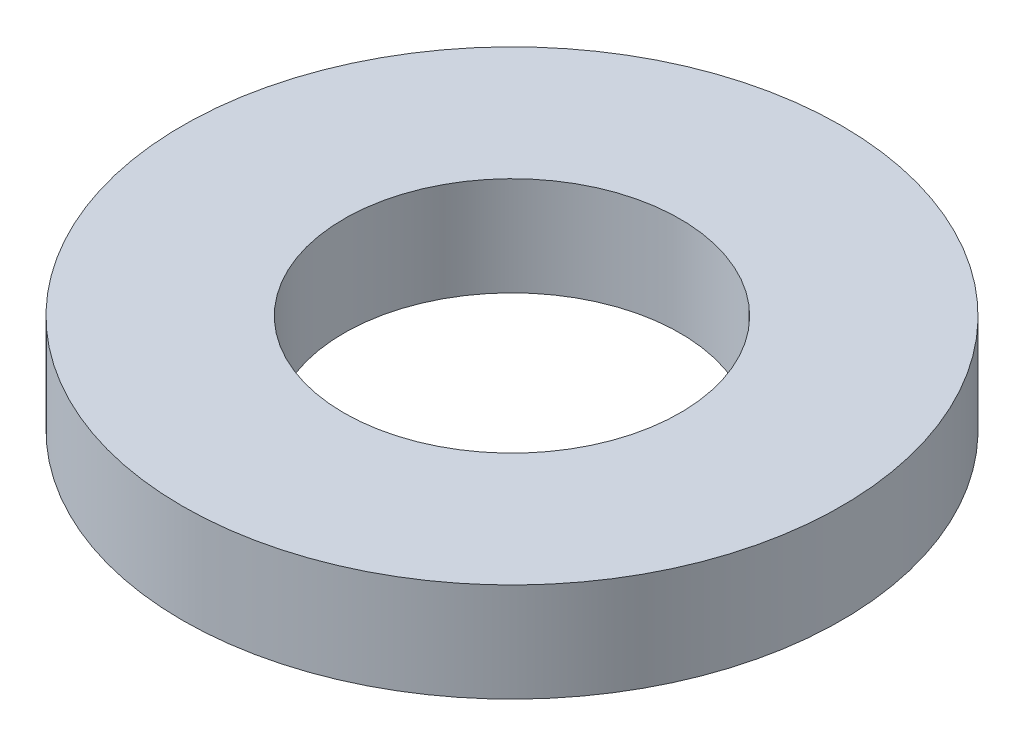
from build123d import *

# Parameters (mm, degrees)
SKETCH1_R           = 10
SKETCH1_R_2         = 5.1
BOSS_EXTRUDE1_DEPTH = 3


with BuildPart() as part:
    # Sketch1 → Boss-Extrude1 (new body)
    with BuildSketch(Plane(origin=(0, 0, 0), x_dir=(1, 0, 0), z_dir=(0, 1, 0))):
        with Locations(Location((0, 0, 0), (0, 0, 270))):
            Circle(SKETCH1_R)
        with Locations(Location((0, 0, 0), (0, 0, 270))):
            Circle(SKETCH1_R_2, mode=Mode.SUBTRACT)
    extrude(amount=BOSS_EXTRUDE1_DEPTH)


solid = part.part
